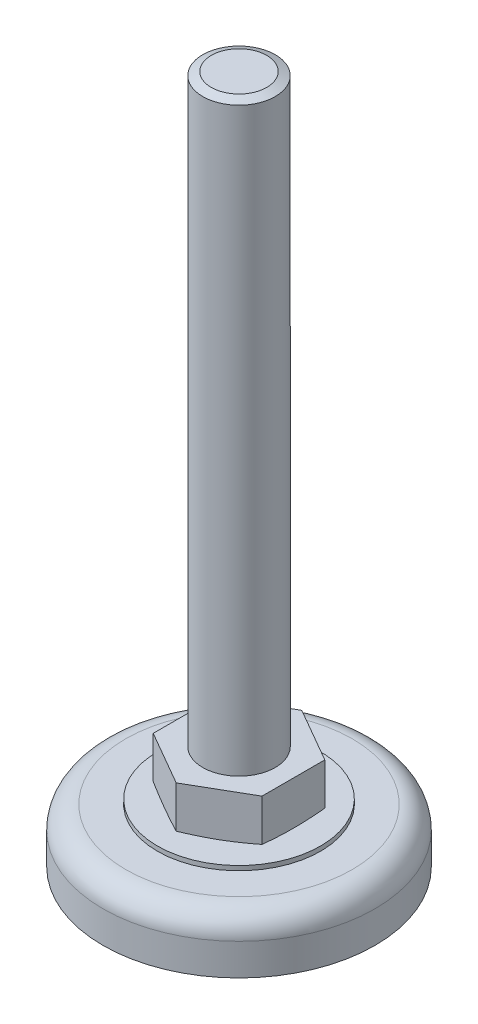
ISO-10303-21;
HEADER;
FILE_DESCRIPTION(('STEP AP214'),'2;1');
FILE_NAME('part.step','',(''),(''),'','','');
FILE_SCHEMA(('AUTOMOTIVE_DESIGN { 1 0 10303 214 1 1 1 1 }'));
ENDSEC;
DATA;
#1=APPLICATION_CONTEXT('core data for automotive mechanical design processes');
#2=APPLICATION_PROTOCOL_DEFINITION('international standard','automotive_design',2000,#1);
#3=PRODUCT_CONTEXT('',#1,'mechanical');
#4=PRODUCT('Part','Part','',(#3));
#5=PRODUCT_RELATED_PRODUCT_CATEGORY('part','',(#4));
#6=PRODUCT_DEFINITION_FORMATION('','',#4);
#7=PRODUCT_DEFINITION_CONTEXT('part definition',#1,'design');
#8=PRODUCT_DEFINITION('design','',#6,#7);
#9=PRODUCT_DEFINITION_SHAPE('','',#8);
#10=(LENGTH_UNIT() NAMED_UNIT(*) SI_UNIT(.MILLI.,.METRE.));
#11=(NAMED_UNIT(*) PLANE_ANGLE_UNIT() SI_UNIT($,.RADIAN.));
#12=(NAMED_UNIT(*) SI_UNIT($,.STERADIAN.) SOLID_ANGLE_UNIT());
#13=UNCERTAINTY_MEASURE_WITH_UNIT(LENGTH_MEASURE(1.E-05),#10,'distance_accuracy_value','');
#14=(GEOMETRIC_REPRESENTATION_CONTEXT(3) GLOBAL_UNCERTAINTY_ASSIGNED_CONTEXT((#13)) GLOBAL_UNIT_ASSIGNED_CONTEXT((#10,
#11,#12)) REPRESENTATION_CONTEXT('',''));
#15=CARTESIAN_POINT('',(0.,0.,0.));
#16=DIRECTION('',(0.,0.,1.));
#17=DIRECTION('',(1.,0.,0.));
#18=AXIS2_PLACEMENT_3D('',#15,#16,#17);
#19=CARTESIAN_POINT('',(10.,4.,0.));
#20=DIRECTION('',(0.,1.,0.));
#21=DIRECTION('',(0.,0.,1.));
#22=AXIS2_PLACEMENT_3D('',#19,#20,#21);
#23=PLANE('',#22);
#24=CARTESIAN_POINT('',(0.,4.,0.));
#25=DIRECTION('',(0.,1.,0.));
#26=DIRECTION('',(0.,0.,1.));
#27=AXIS2_PLACEMENT_3D('',#24,#25,#26);
#28=CIRCLE('',#27,10.);
#29=CARTESIAN_POINT('',(0.,4.,10.));
#30=VERTEX_POINT('',#29);
#31=EDGE_CURVE('E314',#30,#30,#28,.F.);
#32=ORIENTED_EDGE('',*,*,#31,.T.);
#33=EDGE_LOOP('',(#32));
#34=FACE_BOUND('',#33,.T.);
#35=ADVANCED_FACE('F17',(#34),#23,.F.);
#36=CARTESIAN_POINT('',(0.,0.,0.));
#37=DIRECTION('',(0.,1.,0.));
#38=DIRECTION('',(0.,0.,1.));
#39=AXIS2_PLACEMENT_3D('',#36,#37,#38);
#40=CYLINDRICAL_SURFACE('',#39,10.);
#41=CARTESIAN_POINT('',(0.,0.,0.));
#42=DIRECTION('',(0.,1.,0.));
#43=DIRECTION('',(0.,0.,1.));
#44=AXIS2_PLACEMENT_3D('',#41,#42,#43);
#45=CIRCLE('',#44,10.);
#46=CARTESIAN_POINT('',(0.,0.,10.));
#47=VERTEX_POINT('',#46);
#48=EDGE_CURVE('E311',#47,#47,#45,.F.);
#49=ORIENTED_EDGE('',*,*,#48,.T.);
#50=EDGE_LOOP('',(#49));
#51=FACE_BOUND('',#50,.T.);
#52=ORIENTED_EDGE('',*,*,#31,.F.);
#53=EDGE_LOOP('',(#52));
#54=FACE_BOUND('',#53,.T.);
#55=ADVANCED_FACE('F415',(#51,#54),#40,.F.);
#56=CARTESIAN_POINT('',(24.25,0.,0.));
#57=DIRECTION('',(0.,1.,0.));
#58=DIRECTION('',(0.,0.,1.));
#59=AXIS2_PLACEMENT_3D('',#56,#57,#58);
#60=PLANE('',#59);
#61=ORIENTED_EDGE('',*,*,#48,.F.);
#62=EDGE_LOOP('',(#61));
#63=FACE_BOUND('',#62,.T.);
#64=CARTESIAN_POINT('',(0.,0.,0.));
#65=DIRECTION('',(0.,1.,0.));
#66=DIRECTION('',(0.,0.,1.));
#67=AXIS2_PLACEMENT_3D('',#64,#65,#66);
#68=CIRCLE('',#67,24.25);
#69=CARTESIAN_POINT('',(0.,0.,24.25));
#70=VERTEX_POINT('',#69);
#71=EDGE_CURVE('E308',#70,#70,#68,.T.);
#72=ORIENTED_EDGE('',*,*,#71,.F.);
#73=EDGE_LOOP('',(#72));
#74=FACE_BOUND('',#73,.T.);
#75=ADVANCED_FACE('F403',(#63,#74),#60,.F.);
#76=CARTESIAN_POINT('',(0.,0.,0.));
#77=DIRECTION('',(0.,1.,0.));
#78=DIRECTION('',(0.,0.,1.));
#79=AXIS2_PLACEMENT_3D('',#76,#77,#78);
#80=CYLINDRICAL_SURFACE('',#79,24.25);
#81=CARTESIAN_POINT('',(0.,4.,0.));
#82=DIRECTION('',(0.,1.,0.));
#83=DIRECTION('',(0.,0.,1.));
#84=AXIS2_PLACEMENT_3D('',#81,#82,#83);
#85=CIRCLE('',#84,24.25);
#86=CARTESIAN_POINT('',(0.,4.,24.25));
#87=VERTEX_POINT('',#86);
#88=EDGE_CURVE('E305',#87,#87,#85,.F.);
#89=ORIENTED_EDGE('',*,*,#88,.T.);
#90=EDGE_LOOP('',(#89));
#91=FACE_BOUND('',#90,.T.);
#92=ORIENTED_EDGE('',*,*,#71,.T.);
#93=EDGE_LOOP('',(#92));
#94=FACE_BOUND('',#93,.T.);
#95=ADVANCED_FACE('F396',(#91,#94),#80,.T.);
#96=CARTESIAN_POINT('',(30.,4.,0.));
#97=DIRECTION('',(0.,1.,0.));
#98=DIRECTION('',(0.,0.,1.));
#99=AXIS2_PLACEMENT_3D('',#96,#97,#98);
#100=PLANE('',#99);
#101=ORIENTED_EDGE('',*,*,#88,.F.);
#102=EDGE_LOOP('',(#101));
#103=FACE_BOUND('',#102,.T.);
#104=CARTESIAN_POINT('',(0.,4.,0.));
#105=DIRECTION('',(0.,1.,0.));
#106=DIRECTION('',(0.,0.,1.));
#107=AXIS2_PLACEMENT_3D('',#104,#105,#106);
#108=CIRCLE('',#107,30.);
#109=CARTESIAN_POINT('',(0.,4.,30.));
#110=VERTEX_POINT('',#109);
#111=EDGE_CURVE('E170',#110,#110,#108,.T.);
#112=ORIENTED_EDGE('',*,*,#111,.F.);
#113=EDGE_LOOP('',(#112));
#114=FACE_BOUND('',#113,.T.);
#115=ADVANCED_FACE('F402',(#103,#114),#100,.F.);
#116=CARTESIAN_POINT('',(0.,0.,0.));
#117=DIRECTION('',(0.,1.,0.));
#118=DIRECTION('',(0.,0.,1.));
#119=AXIS2_PLACEMENT_3D('',#116,#117,#118);
#120=CYLINDRICAL_SURFACE('',#119,30.);
#121=CARTESIAN_POINT('',(0.,11.,0.));
#122=DIRECTION('',(0.,1.,0.));
#123=DIRECTION('',(0.,0.,1.));
#124=AXIS2_PLACEMENT_3D('',#121,#122,#123);
#125=CIRCLE('',#124,30.);
#126=CARTESIAN_POINT('',(0.,11.,30.));
#127=VERTEX_POINT('',#126);
#128=EDGE_CURVE('E162',#127,#127,#125,.T.);
#129=ORIENTED_EDGE('',*,*,#128,.F.);
#130=EDGE_LOOP('',(#129));
#131=FACE_BOUND('',#130,.T.);
#132=ORIENTED_EDGE('',*,*,#111,.T.);
#133=EDGE_LOOP('',(#132));
#134=FACE_BOUND('',#133,.T.);
#135=ADVANCED_FACE('F469',(#131,#134),#120,.T.);
#136=CARTESIAN_POINT('',(0.,11.,0.));
#137=DIRECTION('',(0.,1.,0.));
#138=DIRECTION('',(0.,0.,1.));
#139=AXIS2_PLACEMENT_3D('',#136,#137,#138);
#140=TOROIDAL_SURFACE('',#139,25.,5.);
#141=CARTESIAN_POINT('',(0.,16.,0.));
#142=DIRECTION('',(0.,-1.,0.));
#143=DIRECTION('',(0.,0.,1.));
#144=AXIS2_PLACEMENT_3D('',#141,#142,#143);
#145=CIRCLE('',#144,25.);
#146=CARTESIAN_POINT('',(0.,16.,25.));
#147=VERTEX_POINT('',#146);
#148=CARTESIAN_POINT('',(0.,16.,-25.));
#149=VERTEX_POINT('',#148);
#150=EDGE_CURVE('E125',#147,#149,#145,.T.);
#151=ORIENTED_EDGE('',*,*,#150,.T.);
#152=CARTESIAN_POINT('',(0.,16.,0.));
#153=DIRECTION('',(0.,-1.,0.));
#154=DIRECTION('',(0.,0.,-1.));
#155=AXIS2_PLACEMENT_3D('',#152,#153,#154);
#156=CIRCLE('',#155,25.);
#157=EDGE_CURVE('E158',#149,#147,#156,.T.);
#158=ORIENTED_EDGE('',*,*,#157,.T.);
#159=EDGE_LOOP('',(#151,#158));
#160=FACE_BOUND('',#159,.T.);
#161=ORIENTED_EDGE('',*,*,#128,.T.);
#162=EDGE_LOOP('',(#161));
#163=FACE_BOUND('',#162,.T.);
#164=ADVANCED_FACE('F141',(#160,#163),#140,.T.);
#165=CARTESIAN_POINT('',(18.,16.,0.));
#166=DIRECTION('',(0.,-1.,0.));
#167=DIRECTION('',(0.,0.,-1.));
#168=AXIS2_PLACEMENT_3D('',#165,#166,#167);
#169=PLANE('',#168);
#170=ORIENTED_EDGE('',*,*,#150,.F.);
#171=ORIENTED_EDGE('',*,*,#157,.F.);
#172=EDGE_LOOP('',(#170,#171));
#173=FACE_BOUND('',#172,.T.);
#174=CARTESIAN_POINT('',(0.,16.,0.));
#175=DIRECTION('',(0.,1.,0.));
#176=DIRECTION('',(0.,0.,1.));
#177=AXIS2_PLACEMENT_3D('',#174,#175,#176);
#178=CIRCLE('',#177,18.);
#179=CARTESIAN_POINT('',(0.,16.,18.));
#180=VERTEX_POINT('',#179);
#181=EDGE_CURVE('E298',#180,#180,#178,.T.);
#182=ORIENTED_EDGE('',*,*,#181,.F.);
#183=EDGE_LOOP('',(#182));
#184=FACE_BOUND('',#183,.T.);
#185=ADVANCED_FACE('F131',(#173,#184),#169,.F.);
#186=CARTESIAN_POINT('',(0.,0.,0.));
#187=DIRECTION('',(0.,1.,0.));
#188=DIRECTION('',(0.,0.,1.));
#189=AXIS2_PLACEMENT_3D('',#186,#187,#188);
#190=CYLINDRICAL_SURFACE('',#189,18.);
#191=CARTESIAN_POINT('',(0.,17.,0.));
#192=DIRECTION('',(0.,1.,0.));
#193=DIRECTION('',(0.,0.,1.));
#194=AXIS2_PLACEMENT_3D('',#191,#192,#193);
#195=CIRCLE('',#194,18.);
#196=CARTESIAN_POINT('',(0.,17.,18.));
#197=VERTEX_POINT('',#196);
#198=EDGE_CURVE('E294',#197,#197,#195,.F.);
#199=ORIENTED_EDGE('',*,*,#198,.T.);
#200=EDGE_LOOP('',(#199));
#201=FACE_BOUND('',#200,.T.);
#202=ORIENTED_EDGE('',*,*,#181,.T.);
#203=EDGE_LOOP('',(#202));
#204=FACE_BOUND('',#203,.T.);
#205=ADVANCED_FACE('F140',(#201,#204),#190,.T.);
#206=CARTESIAN_POINT('',(10.,17.,0.));
#207=DIRECTION('',(0.,-1.,0.));
#208=DIRECTION('',(0.,0.,-1.));
#209=AXIS2_PLACEMENT_3D('',#206,#207,#208);
#210=PLANE('',#209);
#211=ORIENTED_EDGE('',*,*,#198,.F.);
#212=EDGE_LOOP('',(#211));
#213=FACE_BOUND('',#212,.T.);
#214=CARTESIAN_POINT('',(0.,17.,0.));
#215=DIRECTION('',(0.,1.,0.));
#216=DIRECTION('',(0.,0.,1.));
#217=AXIS2_PLACEMENT_3D('',#214,#215,#216);
#218=CIRCLE('',#217,10.);
#219=CARTESIAN_POINT('',(0.,17.,10.));
#220=VERTEX_POINT('',#219);
#221=EDGE_CURVE('E292',#220,#220,#218,.T.);
#222=ORIENTED_EDGE('',*,*,#221,.F.);
#223=EDGE_LOOP('',(#222));
#224=FACE_BOUND('',#223,.T.);
#225=ADVANCED_FACE('F193',(#213,#224),#210,.F.);
#226=CARTESIAN_POINT('',(0.,17.7759089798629,0.));
#227=DIRECTION('',(0.,1.,0.));
#228=DIRECTION('',(0.,0.,1.));
#229=AXIS2_PLACEMENT_3D('',#226,#227,#228);
#230=CONICAL_SURFACE('',#229,13.8795448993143,1.37340076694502);
#231=CARTESIAN_POINT('',(-12.,17.7712812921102,-6.92820323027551));
#232=CARTESIAN_POINT('',(-11.5009349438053,17.7136311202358,-7.21633857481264));
#233=CARTESIAN_POINT('',(-11.0013619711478,17.6613507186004,-7.50476716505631));
#234=CARTESIAN_POINT('',(-10.0012320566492,17.5695660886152,-8.08219244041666));
#235=CARTESIAN_POINT('',(-9.50067492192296,17.5300646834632,-8.37118923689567));
#236=CARTESIAN_POINT('',(-8.50027451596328,17.4659945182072,-8.9487706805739));
#237=CARTESIAN_POINT('',(-8.00043335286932,17.4413829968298,-9.23735411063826));
#238=CARTESIAN_POINT('',(-7.00039476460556,17.4083865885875,-9.81472665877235));
#239=CARTESIAN_POINT('',(-6.50019738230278,17.4,-10.1035157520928));
#240=CARTESIAN_POINT('',(-5.49980261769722,17.4,-10.6810939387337));
#241=CARTESIAN_POINT('',(-4.99960523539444,17.4083865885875,-10.9698830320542));
#242=CARTESIAN_POINT('',(-3.99956664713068,17.4413829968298,-11.5472555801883));
#243=CARTESIAN_POINT('',(-3.49972548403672,17.4659945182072,-11.8358390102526));
#244=CARTESIAN_POINT('',(-2.49932507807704,17.5300646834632,-12.4134204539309));
#245=CARTESIAN_POINT('',(-1.99876794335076,17.5695660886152,-12.7024172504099));
#246=CARTESIAN_POINT('',(-0.998638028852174,17.6613507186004,-13.2798425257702));
#247=CARTESIAN_POINT('',(-0.499065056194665,17.7136311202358,-13.5682711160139));
#248=CARTESIAN_POINT('',(0.,17.7712812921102,-13.856406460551));
#249=B_SPLINE_CURVE_WITH_KNOTS('',3,(#231,#232,#233,#234,#235,#236,#237,#238,#239,#240,#241,
#242,#243,#244,#245,#246,#247,#248),.UNSPECIFIED.,.F.,.F.,(4,2,2,2,2,2,2,2,4),(0.,
1.73749037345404,3.4753643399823,5.20822343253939,6.94090076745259,8.6735781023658,
10.4064371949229,12.1443111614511,13.8818015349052),.UNSPECIFIED.);
#250=CARTESIAN_POINT('',(-12.,17.7712812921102,-6.92820323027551));
#251=VERTEX_POINT('',#250);
#252=CARTESIAN_POINT('',(0.,17.7712812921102,-13.856406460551));
#253=VERTEX_POINT('',#252);
#254=EDGE_CURVE('E181',#251,#253,#249,.T.);
#255=ORIENTED_EDGE('',*,*,#254,.T.);
#256=CARTESIAN_POINT('',(0.,17.7712812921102,-13.856406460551));
#257=CARTESIAN_POINT('',(0.499065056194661,17.7136311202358,-13.5682711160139));
#258=CARTESIAN_POINT('',(0.998638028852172,17.6613507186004,-13.2798425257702));
#259=CARTESIAN_POINT('',(1.99876794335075,17.5695660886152,-12.7024172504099));
#260=CARTESIAN_POINT('',(2.49932507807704,17.5300646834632,-12.4134204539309));
#261=CARTESIAN_POINT('',(3.49972548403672,17.4659945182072,-11.8358390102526));
#262=CARTESIAN_POINT('',(3.99956664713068,17.4413829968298,-11.5472555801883));
#263=CARTESIAN_POINT('',(4.99960523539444,17.4083865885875,-10.9698830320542));
#264=CARTESIAN_POINT('',(5.49980261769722,17.4,-10.6810939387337));
#265=CARTESIAN_POINT('',(6.50019738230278,17.4,-10.1035157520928));
#266=CARTESIAN_POINT('',(7.00039476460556,17.4083865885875,-9.81472665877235));
#267=CARTESIAN_POINT('',(8.00043335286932,17.4413829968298,-9.23735411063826));
#268=CARTESIAN_POINT('',(8.50027451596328,17.4659945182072,-8.9487706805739));
#269=CARTESIAN_POINT('',(9.50067492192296,17.5300646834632,-8.37118923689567));
#270=CARTESIAN_POINT('',(10.0012320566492,17.5695660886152,-8.08219244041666));
#271=CARTESIAN_POINT('',(11.0013619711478,17.6613507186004,-7.50476716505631));
#272=CARTESIAN_POINT('',(11.5009349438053,17.7136311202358,-7.21633857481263));
#273=CARTESIAN_POINT('',(12.,17.7712812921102,-6.92820323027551));
#274=B_SPLINE_CURVE_WITH_KNOTS('',3,(#256,#257,#258,#259,#260,#261,#262,#263,#264,#265,#266,
#267,#268,#269,#270,#271,#272,#273),.UNSPECIFIED.,.F.,.F.,(4,2,2,2,2,2,2,2,4),(0.,
1.73749037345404,3.4753643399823,5.20822343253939,6.94090076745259,8.6735781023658,
10.4064371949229,12.1443111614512,13.8818015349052),.UNSPECIFIED.);
#275=CARTESIAN_POINT('',(12.,17.7712812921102,-6.92820323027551));
#276=VERTEX_POINT('',#275);
#277=EDGE_CURVE('E75',#253,#276,#274,.T.);
#278=ORIENTED_EDGE('',*,*,#277,.T.);
#279=CARTESIAN_POINT('',(12.,17.7712812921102,-6.92820323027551));
#280=CARTESIAN_POINT('',(12.,17.7136311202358,-6.35193254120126));
#281=CARTESIAN_POINT('',(12.,17.6613507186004,-5.77507536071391));
#282=CARTESIAN_POINT('',(12.,17.5695660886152,-4.62022480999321));
#283=CARTESIAN_POINT('',(12.,17.5300646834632,-4.04223121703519));
#284=CARTESIAN_POINT('',(12.,17.4659945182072,-2.88706832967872));
#285=CARTESIAN_POINT('',(12.,17.4413829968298,-2.30990146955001));
#286=CARTESIAN_POINT('',(12.,17.4083865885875,-1.15515637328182));
#287=CARTESIAN_POINT('',(12.,17.4,-0.577578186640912));
#288=CARTESIAN_POINT('',(12.,17.4,0.577578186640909));
#289=CARTESIAN_POINT('',(12.,17.4083865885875,1.15515637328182));
#290=CARTESIAN_POINT('',(12.,17.4413829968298,2.30990146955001));
#291=CARTESIAN_POINT('',(12.,17.4659945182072,2.88706832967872));
#292=CARTESIAN_POINT('',(12.,17.5300646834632,4.04223121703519));
#293=CARTESIAN_POINT('',(12.,17.5695660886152,4.6202248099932));
#294=CARTESIAN_POINT('',(12.,17.6613507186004,5.77507536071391));
#295=CARTESIAN_POINT('',(12.,17.7136311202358,6.35193254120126));
#296=CARTESIAN_POINT('',(12.,17.7712812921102,6.92820323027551));
#297=B_SPLINE_CURVE_WITH_KNOTS('',3,(#279,#280,#281,#282,#283,#284,#285,#286,#287,#288,#289,
#290,#291,#292,#293,#294,#295,#296),.UNSPECIFIED.,.F.,.F.,(4,2,2,2,2,2,2,2,4),(0.,
1.73749037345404,3.4753643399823,5.20822343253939,6.9409007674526,8.6735781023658,
10.4064371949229,12.1443111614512,13.8818015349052),.UNSPECIFIED.);
#298=CARTESIAN_POINT('',(12.,17.7712812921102,6.92820323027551));
#299=VERTEX_POINT('',#298);
#300=EDGE_CURVE('E87',#276,#299,#297,.T.);
#301=ORIENTED_EDGE('',*,*,#300,.T.);
#302=CARTESIAN_POINT('',(12.,17.7712812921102,6.92820323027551));
#303=CARTESIAN_POINT('',(11.5009349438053,17.7136311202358,7.21633857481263));
#304=CARTESIAN_POINT('',(11.0013619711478,17.6613507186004,7.50476716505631));
#305=CARTESIAN_POINT('',(10.0012320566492,17.5695660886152,8.08219244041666));
#306=CARTESIAN_POINT('',(9.50067492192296,17.5300646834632,8.37118923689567));
#307=CARTESIAN_POINT('',(8.50027451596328,17.4659945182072,8.9487706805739));
#308=CARTESIAN_POINT('',(8.00043335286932,17.4413829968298,9.23735411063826));
#309=CARTESIAN_POINT('',(7.00039476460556,17.4083865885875,9.81472665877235));
#310=CARTESIAN_POINT('',(6.50019738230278,17.4,10.1035157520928));
#311=CARTESIAN_POINT('',(5.49980261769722,17.4,10.6810939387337));
#312=CARTESIAN_POINT('',(4.99960523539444,17.4083865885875,10.9698830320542));
#313=CARTESIAN_POINT('',(3.99956664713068,17.4413829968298,11.5472555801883));
#314=CARTESIAN_POINT('',(3.49972548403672,17.4659945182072,11.8358390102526));
#315=CARTESIAN_POINT('',(2.49932507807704,17.5300646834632,12.4134204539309));
#316=CARTESIAN_POINT('',(1.99876794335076,17.5695660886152,12.7024172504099));
#317=CARTESIAN_POINT('',(0.998638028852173,17.6613507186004,13.2798425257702));
#318=CARTESIAN_POINT('',(0.499065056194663,17.7136311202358,13.5682711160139));
#319=CARTESIAN_POINT('',(0.,17.7712812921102,13.856406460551));
#320=B_SPLINE_CURVE_WITH_KNOTS('',3,(#302,#303,#304,#305,#306,#307,#308,#309,#310,#311,#312,
#313,#314,#315,#316,#317,#318,#319),.UNSPECIFIED.,.F.,.F.,(4,2,2,2,2,2,2,2,4),(0.,
1.73749037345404,3.4753643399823,5.20822343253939,6.94090076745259,8.6735781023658,
10.4064371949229,12.1443111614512,13.8818015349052),.UNSPECIFIED.);
#321=CARTESIAN_POINT('',(0.,17.7712812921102,13.856406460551));
#322=VERTEX_POINT('',#321);
#323=EDGE_CURVE('E220',#299,#322,#320,.T.);
#324=ORIENTED_EDGE('',*,*,#323,.T.);
#325=CARTESIAN_POINT('',(0.,17.7712812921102,13.856406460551));
#326=CARTESIAN_POINT('',(-0.499065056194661,17.7136311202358,13.5682711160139));
#327=CARTESIAN_POINT('',(-0.998638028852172,17.6613507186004,13.2798425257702));
#328=CARTESIAN_POINT('',(-1.99876794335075,17.5695660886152,12.7024172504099));
#329=CARTESIAN_POINT('',(-2.49932507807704,17.5300646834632,12.4134204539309));
#330=CARTESIAN_POINT('',(-3.49972548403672,17.4659945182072,11.8358390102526));
#331=CARTESIAN_POINT('',(-3.99956664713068,17.4413829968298,11.5472555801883));
#332=CARTESIAN_POINT('',(-4.99960523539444,17.4083865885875,10.9698830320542));
#333=CARTESIAN_POINT('',(-5.49980261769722,17.4,10.6810939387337));
#334=CARTESIAN_POINT('',(-6.50019738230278,17.4,10.1035157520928));
#335=CARTESIAN_POINT('',(-7.00039476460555,17.4083865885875,9.81472665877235));
#336=CARTESIAN_POINT('',(-8.00043335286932,17.4413829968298,9.23735411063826));
#337=CARTESIAN_POINT('',(-8.50027451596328,17.4659945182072,8.9487706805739));
#338=CARTESIAN_POINT('',(-9.50067492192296,17.5300646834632,8.37118923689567));
#339=CARTESIAN_POINT('',(-10.0012320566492,17.5695660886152,8.08219244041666));
#340=CARTESIAN_POINT('',(-11.0013619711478,17.6613507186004,7.50476716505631));
#341=CARTESIAN_POINT('',(-11.5009349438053,17.7136311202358,7.21633857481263));
#342=CARTESIAN_POINT('',(-12.,17.7712812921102,6.92820323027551));
#343=B_SPLINE_CURVE_WITH_KNOTS('',3,(#325,#326,#327,#328,#329,#330,#331,#332,#333,#334,#335,
#336,#337,#338,#339,#340,#341,#342),.UNSPECIFIED.,.F.,.F.,(4,2,2,2,2,2,2,2,4),(0.,
1.73749037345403,3.4753643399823,5.20822343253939,6.94090076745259,8.6735781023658,
10.4064371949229,12.1443111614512,13.8818015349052),.UNSPECIFIED.);
#344=CARTESIAN_POINT('',(-12.,17.7712812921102,6.92820323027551));
#345=VERTEX_POINT('',#344);
#346=EDGE_CURVE('E213',#322,#345,#343,.T.);
#347=ORIENTED_EDGE('',*,*,#346,.T.);
#348=CARTESIAN_POINT('',(-12.,17.7712812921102,6.92820323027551));
#349=CARTESIAN_POINT('',(-12.,17.7136311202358,6.35193254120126));
#350=CARTESIAN_POINT('',(-12.,17.6613507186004,5.77507536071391));
#351=CARTESIAN_POINT('',(-12.,17.5695660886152,4.62022480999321));
#352=CARTESIAN_POINT('',(-12.,17.5300646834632,4.04223121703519));
#353=CARTESIAN_POINT('',(-12.,17.4659945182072,2.88706832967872));
#354=CARTESIAN_POINT('',(-12.,17.4413829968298,2.30990146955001));
#355=CARTESIAN_POINT('',(-12.,17.4083865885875,1.15515637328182));
#356=CARTESIAN_POINT('',(-12.,17.4,0.57757818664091));
#357=CARTESIAN_POINT('',(-12.,17.4,-0.577578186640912));
#358=CARTESIAN_POINT('',(-12.,17.4083865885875,-1.15515637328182));
#359=CARTESIAN_POINT('',(-12.,17.4413829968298,-2.30990146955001));
#360=CARTESIAN_POINT('',(-12.,17.4659945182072,-2.88706832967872));
#361=CARTESIAN_POINT('',(-12.,17.5300646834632,-4.04223121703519));
#362=CARTESIAN_POINT('',(-12.,17.5695660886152,-4.62022480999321));
#363=CARTESIAN_POINT('',(-12.,17.6613507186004,-5.77507536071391));
#364=CARTESIAN_POINT('',(-12.,17.7136311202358,-6.35193254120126));
#365=CARTESIAN_POINT('',(-12.,17.7712812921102,-6.92820323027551));
#366=B_SPLINE_CURVE_WITH_KNOTS('',3,(#348,#349,#350,#351,#352,#353,#354,#355,#356,#357,#358,
#359,#360,#361,#362,#363,#364,#365),.UNSPECIFIED.,.F.,.F.,(4,2,2,2,2,2,2,2,4),(0.,
1.73749037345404,3.4753643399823,5.20822343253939,6.9409007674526,8.6735781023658,
10.4064371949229,12.1443111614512,13.8818015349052),.UNSPECIFIED.);
#367=EDGE_CURVE('E207',#345,#251,#366,.T.);
#368=ORIENTED_EDGE('',*,*,#367,.T.);
#369=EDGE_LOOP('',(#255,#278,#301,#324,#347,#368));
#370=FACE_BOUND('',#369,.T.);
#371=ORIENTED_EDGE('',*,*,#221,.T.);
#372=EDGE_LOOP('',(#371));
#373=FACE_BOUND('',#372,.T.);
#374=ADVANCED_FACE('F189',(#370,#373),#230,.T.);
#375=CARTESIAN_POINT('',(12.,28.,6.92820323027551));
#376=DIRECTION('',(-1.,0.,0.));
#377=DIRECTION('',(0.,0.,1.));
#378=AXIS2_PLACEMENT_3D('',#375,#376,#377);
#379=PLANE('',#378);
#380=ORIENTED_EDGE('',*,*,#300,.F.);
#381=DIRECTION('',(0.,1.,0.));
#382=VECTOR('',#381,1.);
#383=CARTESIAN_POINT('',(12.,28.,-6.92820323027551));
#384=LINE('',#383,#382);
#385=CARTESIAN_POINT('',(12.,27.,-6.92820323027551));
#386=VERTEX_POINT('',#385);
#387=EDGE_CURVE('E80',#276,#386,#384,.T.);
#388=ORIENTED_EDGE('',*,*,#387,.T.);
#389=DIRECTION('',(0.,0.,-1.));
#390=VECTOR('',#389,1.);
#391=CARTESIAN_POINT('',(12.,27.,0.));
#392=LINE('',#391,#390);
#393=CARTESIAN_POINT('',(12.,27.,6.92820323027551));
#394=VERTEX_POINT('',#393);
#395=EDGE_CURVE('E85',#386,#394,#392,.F.);
#396=ORIENTED_EDGE('',*,*,#395,.T.);
#397=DIRECTION('',(0.,1.,0.));
#398=VECTOR('',#397,1.);
#399=CARTESIAN_POINT('',(12.,28.,6.92820323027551));
#400=LINE('',#399,#398);
#401=EDGE_CURVE('E289',#394,#299,#400,.F.);
#402=ORIENTED_EDGE('',*,*,#401,.T.);
#403=EDGE_LOOP('',(#380,#388,#396,#402));
#404=FACE_BOUND('',#403,.T.);
#405=ADVANCED_FACE('F82',(#404),#379,.F.);
#406=CARTESIAN_POINT('',(0.,28.,13.856406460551));
#407=DIRECTION('',(-0.5,0.,-0.866025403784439));
#408=DIRECTION('',(-0.866025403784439,0.,0.5));
#409=AXIS2_PLACEMENT_3D('',#406,#407,#408);
#410=PLANE('',#409);
#411=ORIENTED_EDGE('',*,*,#323,.F.);
#412=ORIENTED_EDGE('',*,*,#401,.F.);
#413=DIRECTION('',(-0.866025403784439,0.,0.5));
#414=VECTOR('',#413,1.);
#415=CARTESIAN_POINT('',(12.,27.,6.92820323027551));
#416=LINE('',#415,#414);
#417=CARTESIAN_POINT('',(0.,27.,13.856406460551));
#418=VERTEX_POINT('',#417);
#419=EDGE_CURVE('E100',#394,#418,#416,.T.);
#420=ORIENTED_EDGE('',*,*,#419,.T.);
#421=DIRECTION('',(0.,1.,0.));
#422=VECTOR('',#421,1.);
#423=CARTESIAN_POINT('',(0.,28.,13.856406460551));
#424=LINE('',#423,#422);
#425=EDGE_CURVE('E219',#418,#322,#424,.F.);
#426=ORIENTED_EDGE('',*,*,#425,.T.);
#427=EDGE_LOOP('',(#411,#412,#420,#426));
#428=FACE_BOUND('',#427,.T.);
#429=ADVANCED_FACE('F228',(#428),#410,.F.);
#430=CARTESIAN_POINT('',(-12.,28.,6.92820323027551));
#431=DIRECTION('',(0.5,0.,-0.866025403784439));
#432=DIRECTION('',(-0.866025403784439,0.,-0.5));
#433=AXIS2_PLACEMENT_3D('',#430,#431,#432);
#434=PLANE('',#433);
#435=ORIENTED_EDGE('',*,*,#346,.F.);
#436=ORIENTED_EDGE('',*,*,#425,.F.);
#437=DIRECTION('',(-0.866025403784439,0.,-0.5));
#438=VECTOR('',#437,1.);
#439=CARTESIAN_POINT('',(0.,27.,13.856406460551));
#440=LINE('',#439,#438);
#441=CARTESIAN_POINT('',(-12.,27.,6.92820323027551));
#442=VERTEX_POINT('',#441);
#443=EDGE_CURVE('E102',#418,#442,#440,.T.);
#444=ORIENTED_EDGE('',*,*,#443,.T.);
#445=DIRECTION('',(0.,1.,0.));
#446=VECTOR('',#445,1.);
#447=CARTESIAN_POINT('',(-12.,28.,6.92820323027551));
#448=LINE('',#447,#446);
#449=EDGE_CURVE('E218',#442,#345,#448,.F.);
#450=ORIENTED_EDGE('',*,*,#449,.T.);
#451=EDGE_LOOP('',(#435,#436,#444,#450));
#452=FACE_BOUND('',#451,.T.);
#453=ADVANCED_FACE('F224',(#452),#434,.F.);
#454=CARTESIAN_POINT('',(-12.,28.,-6.92820323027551));
#455=DIRECTION('',(1.,0.,0.));
#456=DIRECTION('',(0.,0.,-1.));
#457=AXIS2_PLACEMENT_3D('',#454,#455,#456);
#458=PLANE('',#457);
#459=ORIENTED_EDGE('',*,*,#367,.F.);
#460=ORIENTED_EDGE('',*,*,#449,.F.);
#461=DIRECTION('',(0.,0.,-1.));
#462=VECTOR('',#461,1.);
#463=CARTESIAN_POINT('',(-12.,27.,0.));
#464=LINE('',#463,#462);
#465=CARTESIAN_POINT('',(-12.,27.,-6.92820323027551));
#466=VERTEX_POINT('',#465);
#467=EDGE_CURVE('E110',#442,#466,#464,.T.);
#468=ORIENTED_EDGE('',*,*,#467,.T.);
#469=DIRECTION('',(0.,1.,0.));
#470=VECTOR('',#469,1.);
#471=CARTESIAN_POINT('',(-12.,28.,-6.92820323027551));
#472=LINE('',#471,#470);
#473=EDGE_CURVE('E272',#466,#251,#472,.F.);
#474=ORIENTED_EDGE('',*,*,#473,.T.);
#475=EDGE_LOOP('',(#459,#460,#468,#474));
#476=FACE_BOUND('',#475,.T.);
#477=ADVANCED_FACE('F227',(#476),#458,.F.);
#478=CARTESIAN_POINT('',(0.,28.,-13.856406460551));
#479=DIRECTION('',(0.5,0.,0.866025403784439));
#480=DIRECTION('',(0.866025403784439,0.,-0.5));
#481=AXIS2_PLACEMENT_3D('',#478,#479,#480);
#482=PLANE('',#481);
#483=ORIENTED_EDGE('',*,*,#254,.F.);
#484=ORIENTED_EDGE('',*,*,#473,.F.);
#485=DIRECTION('',(0.866025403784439,0.,-0.5));
#486=VECTOR('',#485,1.);
#487=CARTESIAN_POINT('',(-12.,27.,-6.92820323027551));
#488=LINE('',#487,#486);
#489=CARTESIAN_POINT('',(0.,27.,-13.856406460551));
#490=VERTEX_POINT('',#489);
#491=EDGE_CURVE('E37',#466,#490,#488,.T.);
#492=ORIENTED_EDGE('',*,*,#491,.T.);
#493=DIRECTION('',(0.,1.,0.));
#494=VECTOR('',#493,1.);
#495=CARTESIAN_POINT('',(0.,28.,-13.856406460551));
#496=LINE('',#495,#494);
#497=EDGE_CURVE('E93',#490,#253,#496,.F.);
#498=ORIENTED_EDGE('',*,*,#497,.T.);
#499=EDGE_LOOP('',(#483,#484,#492,#498));
#500=FACE_BOUND('',#499,.T.);
#501=ADVANCED_FACE('F259',(#500),#482,.F.);
#502=CARTESIAN_POINT('',(12.,28.,-6.92820323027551));
#503=DIRECTION('',(-0.5,0.,0.866025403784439));
#504=DIRECTION('',(0.866025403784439,0.,0.5));
#505=AXIS2_PLACEMENT_3D('',#502,#503,#504);
#506=PLANE('',#505);
#507=ORIENTED_EDGE('',*,*,#277,.F.);
#508=ORIENTED_EDGE('',*,*,#497,.F.);
#509=DIRECTION('',(0.866025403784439,0.,0.5));
#510=VECTOR('',#509,1.);
#511=CARTESIAN_POINT('',(0.,27.,-13.856406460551));
#512=LINE('',#511,#510);
#513=EDGE_CURVE('E91',#490,#386,#512,.T.);
#514=ORIENTED_EDGE('',*,*,#513,.T.);
#515=ORIENTED_EDGE('',*,*,#387,.F.);
#516=EDGE_LOOP('',(#507,#508,#514,#515));
#517=FACE_BOUND('',#516,.T.);
#518=ADVANCED_FACE('F92',(#517),#506,.F.);
#519=CARTESIAN_POINT('',(0.,156.008288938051,0.));
#520=DIRECTION('',(0.,-1.,0.));
#521=DIRECTION('',(0.,0.,-1.));
#522=AXIS2_PLACEMENT_3D('',#519,#520,#521);
#523=PLANE('',#522);
#524=CARTESIAN_POINT('',(0.,156.008288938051,0.));
#525=DIRECTION('',(0.,-1.,0.));
#526=DIRECTION('',(1.,0.,0.));
#527=AXIS2_PLACEMENT_3D('',#524,#525,#526);
#528=CIRCLE('',#527,6.12239975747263);
#529=CARTESIAN_POINT('',(6.12239975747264,156.008288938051,0.));
#530=VERTEX_POINT('',#529);
#531=EDGE_CURVE('E95',#530,#530,#528,.T.);
#532=ORIENTED_EDGE('',*,*,#531,.F.);
#533=EDGE_LOOP('',(#532));
#534=FACE_BOUND('',#533,.T.);
#535=ADVANCED_FACE('F252',(#534),#523,.F.);
#536=CARTESIAN_POINT('',(8.,27.,0.));
#537=DIRECTION('',(0.,-1.,0.));
#538=DIRECTION('',(0.,0.,-1.));
#539=AXIS2_PLACEMENT_3D('',#536,#537,#538);
#540=PLANE('',#539);
#541=CARTESIAN_POINT('',(0.,27.,0.));
#542=DIRECTION('',(0.,1.,0.));
#543=DIRECTION('',(0.,0.,1.));
#544=AXIS2_PLACEMENT_3D('',#541,#542,#543);
#545=CIRCLE('',#544,8.);
#546=CARTESIAN_POINT('',(0.,27.,8.));
#547=VERTEX_POINT('',#546);
#548=EDGE_CURVE('E28',#547,#547,#545,.T.);
#549=ORIENTED_EDGE('',*,*,#548,.F.);
#550=EDGE_LOOP('',(#549));
#551=FACE_BOUND('',#550,.T.);
#552=ORIENTED_EDGE('',*,*,#491,.F.);
#553=ORIENTED_EDGE('',*,*,#467,.F.);
#554=ORIENTED_EDGE('',*,*,#443,.F.);
#555=ORIENTED_EDGE('',*,*,#419,.F.);
#556=ORIENTED_EDGE('',*,*,#395,.F.);
#557=ORIENTED_EDGE('',*,*,#513,.F.);
#558=EDGE_LOOP('',(#552,#553,#554,#555,#556,#557));
#559=FACE_BOUND('',#558,.T.);
#560=ADVANCED_FACE('F98',(#551,#559),#540,.F.);
#561=CARTESIAN_POINT('',(0.,155.205937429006,0.));
#562=DIRECTION('',(0.,-1.,0.));
#563=DIRECTION('',(1.,0.,0.));
#564=AXIS2_PLACEMENT_3D('',#561,#562,#563);
#565=CONICAL_SURFACE('',#564,8.,1.16695533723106);
#566=CARTESIAN_POINT('',(0.,155.205937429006,0.));
#567=DIRECTION('',(0.,1.,0.));
#568=DIRECTION('',(0.,0.,1.));
#569=AXIS2_PLACEMENT_3D('',#566,#567,#568);
#570=CIRCLE('',#569,8.);
#571=CARTESIAN_POINT('',(0.,155.205937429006,8.));
#572=VERTEX_POINT('',#571);
#573=EDGE_CURVE('E11',#572,#572,#570,.F.);
#574=ORIENTED_EDGE('',*,*,#573,.F.);
#575=EDGE_LOOP('',(#574));
#576=FACE_BOUND('',#575,.T.);
#577=ORIENTED_EDGE('',*,*,#531,.T.);
#578=EDGE_LOOP('',(#577));
#579=FACE_BOUND('',#578,.T.);
#580=ADVANCED_FACE('F241',(#576,#579),#565,.T.);
#581=CARTESIAN_POINT('',(0.,0.,0.));
#582=DIRECTION('',(0.,1.,0.));
#583=DIRECTION('',(0.,0.,1.));
#584=AXIS2_PLACEMENT_3D('',#581,#582,#583);
#585=CYLINDRICAL_SURFACE('',#584,8.);
#586=ORIENTED_EDGE('',*,*,#573,.T.);
#587=EDGE_LOOP('',(#586));
#588=FACE_BOUND('',#587,.T.);
#589=ORIENTED_EDGE('',*,*,#548,.T.);
#590=EDGE_LOOP('',(#589));
#591=FACE_BOUND('',#590,.T.);
#592=ADVANCED_FACE('F239',(#588,#591),#585,.T.);
#593=CLOSED_SHELL('',(#35,#55,#75,#95,#115,#135,#164,#185,#205,#225,#374,#405,#429,#453,#477,
#501,#518,#535,#560,#580,#592));
#594=MANIFOLD_SOLID_BREP('B1',#593);
#595=ADVANCED_BREP_SHAPE_REPRESENTATION('',(#18,#594),#14);
#596=SHAPE_DEFINITION_REPRESENTATION(#9,#595);
ENDSEC;
END-ISO-10303-21;
